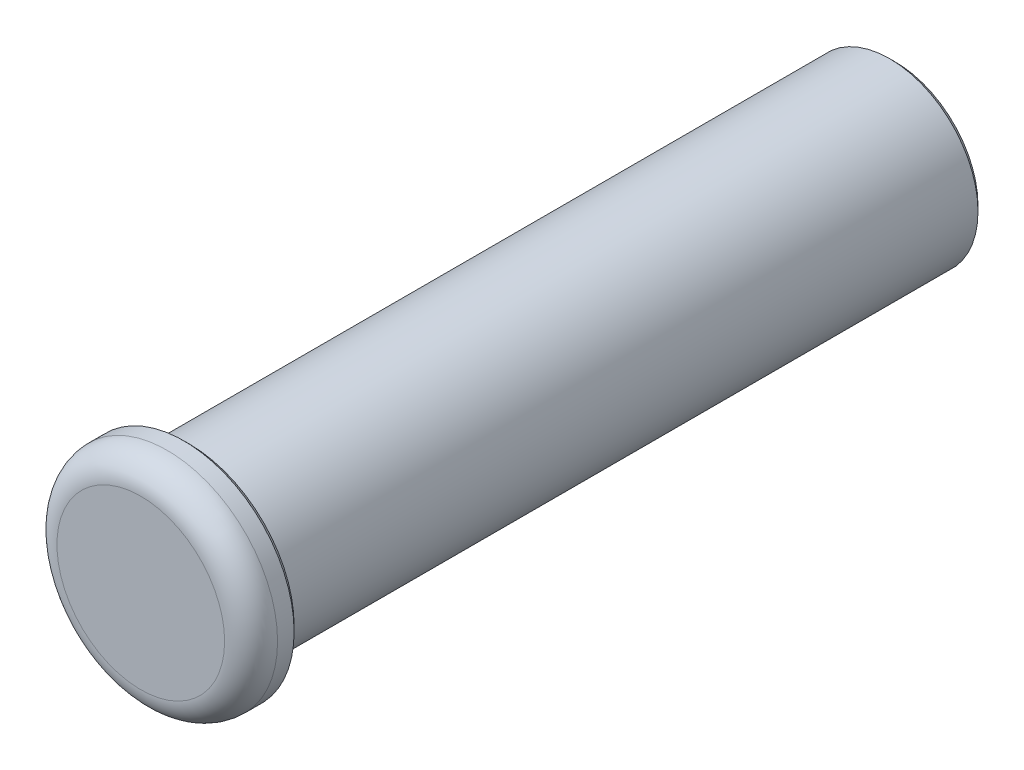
from build123d import *

# Parameters (mm, degrees)
CHAMFER_1_SIZE = 0.25


with BuildPart() as part:
    # Sketch 1 → Revolve 1 (revolve)
    with BuildSketch(Plane(origin=(0, 0, 0), x_dir=(0, 0, -1), z_dir=(1, 0, 0)), mode=Mode.PRIVATE) as revolve_1_sk:
        with BuildLine():
            Line((0, 0), (0, 4))
            Line((0, 4), (-32, 4))
            Line((-32, 4), (-32, 5))
            Line((-32, 5), (-33, 5))
            ThreePointArc((-33, 5), (-33.848528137, 4.648528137), (-34.2, 3.8))
            Line((-34.2, 3.8), (-34.2, 0))
            Line((-34.2, 0), (0, 0))
        make_face()
    revolve(revolve_1_sk.sketch.rotate(Axis((0, 0, 34.2), (0, 0, -1)), 90), axis=Axis((0, 0, 34.2), (0, 0, -1)))

    # Chamfer 1
    chamfer_1_edges = [part.edges().sort_by_distance(p)[0] for p in [
        (-5, 0, 32),
        (-4, 0, 32),
        (-4, 0, 0),
    ]]
    chamfer(chamfer_1_edges, length=CHAMFER_1_SIZE)


solid = part.part
